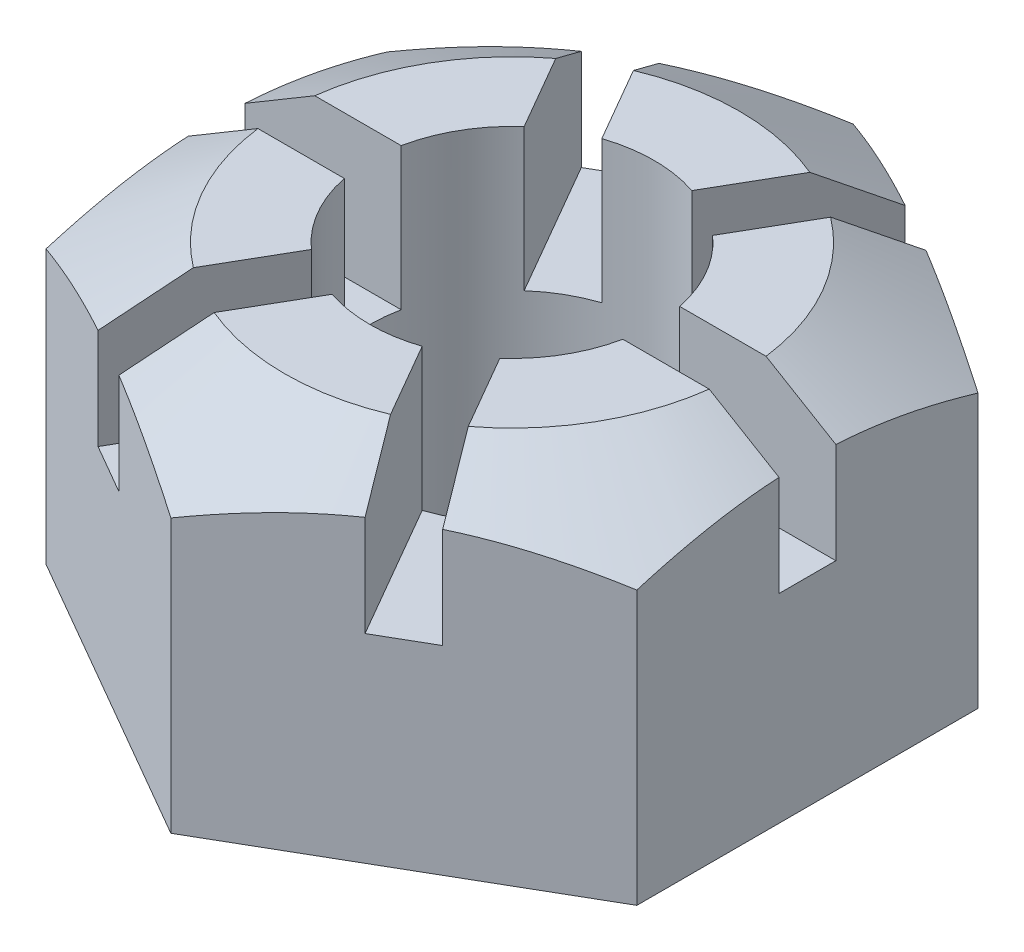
from build123d import *

# Parameters (mm, degrees)
BOSS_EXTRUDE1_DEPTH = 30
SKETCH2_R           = 25
CUT_EXTRUDE1_DEPTH  = 60
SKETCH4_W           = 120
SKETCH4_H           = 10
CUT_EXTRUDE2_DEPTH  = 25


with BuildPart() as part:
    # Sketch1 → Boss-Extrude1 (new, symmetric)
    with BuildSketch(Plane(origin=(0, 0, 0), x_dir=(1, 0, 0), z_dir=(0, 1, 0))):
        Polygon((0, -60), (51.961524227, -30), (51.961524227, 30), (0, 60), (-51.961524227, 30), (-51.961524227, -30), align=None)
    extrude(amount=BOSS_EXTRUDE1_DEPTH, both=True)

    # Sketch2 → Cut-Extrude1 (cut)
    with BuildSketch(Plane(origin=(0, 30, 0), x_dir=(1, 0, 0), z_dir=(0, 1, 0))):
        with Locations(Location((0, 0, 0), (0, 0, 270))):
            Circle(SKETCH2_R)
    extrude(amount=-CUT_EXTRUDE1_DEPTH, mode=Mode.SUBTRACT)

    # Sketch3 → Cut-Revolve1 (revolve, cut)
    with BuildSketch(Plane(origin=(0, 0, 0), x_dir=(0, 0, -1), z_dir=(1, 0, 0))):
        Polygon((40, 30), (60, 18.035252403), (60, 30), align=None)
    revolve(axis=Axis((0, -30, 0), (0, 1, 0)), mode=Mode.SUBTRACT)

    # Sketch4 → Cut-Extrude2 (cut)
    with BuildSketch(Plane(origin=(0, 30, 0), x_dir=(1, 0, 0), z_dir=(0, 1, 0))):
        Polygon((25.669872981, 54.461524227), (-34.330127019, -49.461524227), (-25.669872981, -54.461524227), (34.330127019, 49.461524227), align=None)
        Polygon((34.330127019, -49.461524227), (-25.669872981, 54.461524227), (-34.330127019, 49.461524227), (25.669872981, -54.461524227), align=None)
        Rectangle(SKETCH4_W, SKETCH4_H)
    extrude(amount=-CUT_EXTRUDE2_DEPTH, mode=Mode.SUBTRACT)


solid = part.part
